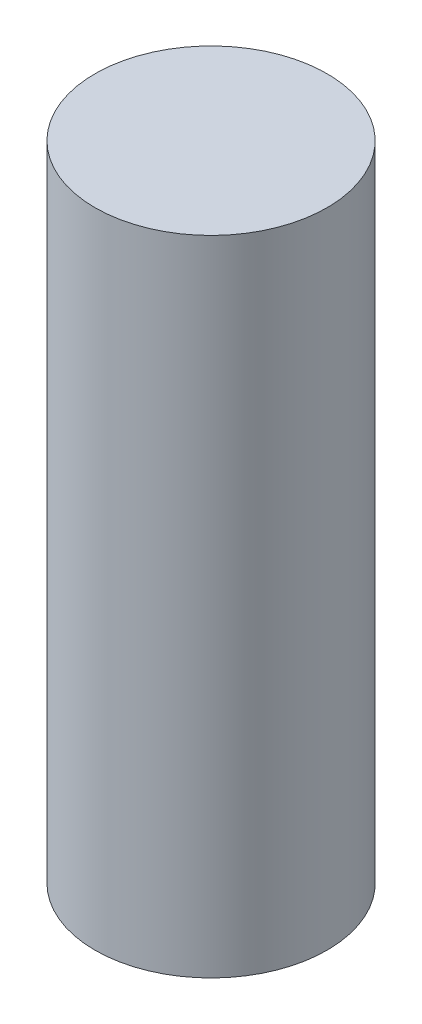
from build123d import *

# Parameters (mm, degrees)
SKETCH1_R      = 36.093842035
EXTRUDE1_DEPTH = 200


with BuildPart() as part:
    # Sketch1 → Extrude1 (new body)
    with BuildSketch(Plane(origin=(0, 0, 0), x_dir=(1, 0, 0), z_dir=(0, 1, 0))):
        with Locations(Location((0, 0, 0), (0, 0, 270))):
            Circle(SKETCH1_R)
    extrude(amount=EXTRUDE1_DEPTH)


solid = part.part
